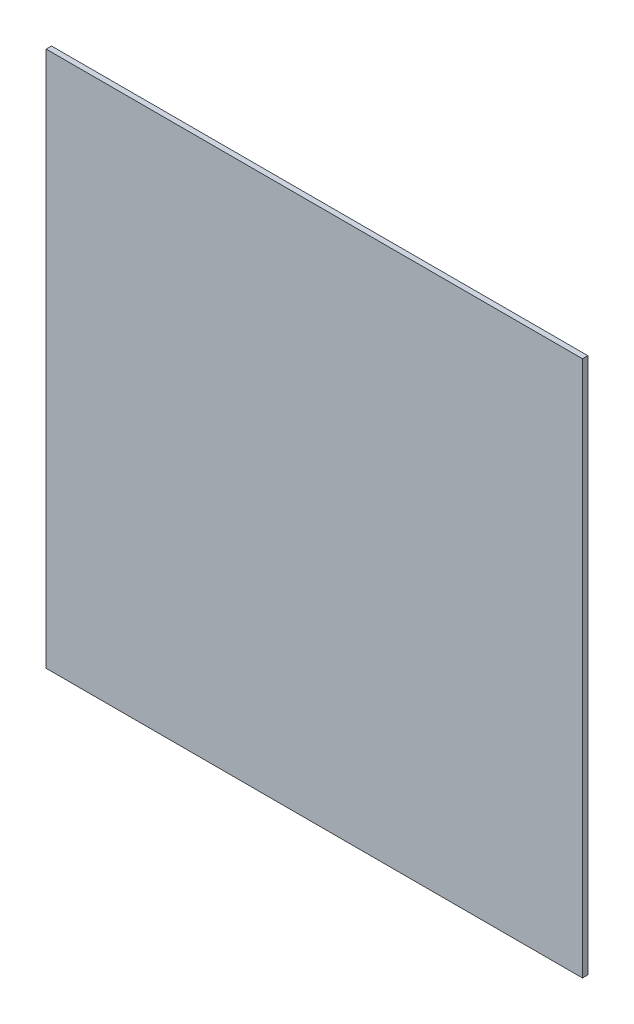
ISO-10303-21;
HEADER;
FILE_DESCRIPTION(('STEP AP214'),'2;1');
FILE_NAME('part.step','',(''),(''),'','','');
FILE_SCHEMA(('AUTOMOTIVE_DESIGN { 1 0 10303 214 1 1 1 1 }'));
ENDSEC;
DATA;
#1=APPLICATION_CONTEXT('core data for automotive mechanical design processes');
#2=APPLICATION_PROTOCOL_DEFINITION('international standard','automotive_design',2000,#1);
#3=PRODUCT_CONTEXT('',#1,'mechanical');
#4=PRODUCT('Part','Part','',(#3));
#5=PRODUCT_RELATED_PRODUCT_CATEGORY('part','',(#4));
#6=PRODUCT_DEFINITION_FORMATION('','',#4);
#7=PRODUCT_DEFINITION_CONTEXT('part definition',#1,'design');
#8=PRODUCT_DEFINITION('design','',#6,#7);
#9=PRODUCT_DEFINITION_SHAPE('','',#8);
#10=(LENGTH_UNIT() NAMED_UNIT(*) SI_UNIT(.MILLI.,.METRE.));
#11=(NAMED_UNIT(*) PLANE_ANGLE_UNIT() SI_UNIT($,.RADIAN.));
#12=(NAMED_UNIT(*) SI_UNIT($,.STERADIAN.) SOLID_ANGLE_UNIT());
#13=UNCERTAINTY_MEASURE_WITH_UNIT(LENGTH_MEASURE(1.E-05),#10,'distance_accuracy_value','');
#14=(GEOMETRIC_REPRESENTATION_CONTEXT(3) GLOBAL_UNCERTAINTY_ASSIGNED_CONTEXT((#13)) GLOBAL_UNIT_ASSIGNED_CONTEXT((#10,
#11,#12)) REPRESENTATION_CONTEXT('',''));
#15=CARTESIAN_POINT('',(0.,0.,0.));
#16=DIRECTION('',(0.,0.,1.));
#17=DIRECTION('',(1.,0.,0.));
#18=AXIS2_PLACEMENT_3D('',#15,#16,#17);
#19=CARTESIAN_POINT('',(0.,0.,2.54));
#20=DIRECTION('',(1.,0.,0.));
#21=DIRECTION('',(0.,0.,-1.));
#22=AXIS2_PLACEMENT_3D('',#19,#20,#21);
#23=PLANE('',#22);
#24=DIRECTION('',(0.,-1.,0.));
#25=VECTOR('',#24,1.);
#26=CARTESIAN_POINT('',(0.,0.,0.));
#27=LINE('',#26,#25);
#28=CARTESIAN_POINT('',(0.,254.,0.));
#29=VERTEX_POINT('',#28);
#30=CARTESIAN_POINT('',(0.,0.,0.));
#31=VERTEX_POINT('',#30);
#32=EDGE_CURVE('E96',#29,#31,#27,.T.);
#33=ORIENTED_EDGE('',*,*,#32,.T.);
#34=DIRECTION('',(0.,0.,-1.));
#35=VECTOR('',#34,1.);
#36=CARTESIAN_POINT('',(0.,0.,2.54));
#37=LINE('',#36,#35);
#38=CARTESIAN_POINT('',(0.,0.,2.54));
#39=VERTEX_POINT('',#38);
#40=EDGE_CURVE('E11',#39,#31,#37,.T.);
#41=ORIENTED_EDGE('',*,*,#40,.F.);
#42=DIRECTION('',(0.,-1.,0.));
#43=VECTOR('',#42,1.);
#44=CARTESIAN_POINT('',(0.,0.,2.54));
#45=LINE('',#44,#43);
#46=CARTESIAN_POINT('',(0.,254.,2.54));
#47=VERTEX_POINT('',#46);
#48=EDGE_CURVE('E84',#47,#39,#45,.T.);
#49=ORIENTED_EDGE('',*,*,#48,.F.);
#50=DIRECTION('',(0.,0.,-1.));
#51=VECTOR('',#50,1.);
#52=CARTESIAN_POINT('',(0.,254.,2.54));
#53=LINE('',#52,#51);
#54=EDGE_CURVE('E92',#47,#29,#53,.T.);
#55=ORIENTED_EDGE('',*,*,#54,.T.);
#56=EDGE_LOOP('',(#33,#41,#49,#55));
#57=FACE_BOUND('',#56,.T.);
#58=ADVANCED_FACE('F33',(#57),#23,.F.);
#59=CARTESIAN_POINT('',(0.,0.,2.54));
#60=DIRECTION('',(0.,1.,0.));
#61=DIRECTION('',(0.,0.,1.));
#62=AXIS2_PLACEMENT_3D('',#59,#60,#61);
#63=PLANE('',#62);
#64=DIRECTION('',(1.,0.,0.));
#65=VECTOR('',#64,1.);
#66=CARTESIAN_POINT('',(0.,0.,0.));
#67=LINE('',#66,#65);
#68=CARTESIAN_POINT('',(254.,0.,0.));
#69=VERTEX_POINT('',#68);
#70=EDGE_CURVE('E88',#31,#69,#67,.T.);
#71=ORIENTED_EDGE('',*,*,#70,.T.);
#72=DIRECTION('',(0.,0.,-1.));
#73=VECTOR('',#72,1.);
#74=CARTESIAN_POINT('',(254.,0.,2.54));
#75=LINE('',#74,#73);
#76=CARTESIAN_POINT('',(254.,0.,2.54));
#77=VERTEX_POINT('',#76);
#78=EDGE_CURVE('E41',#77,#69,#75,.T.);
#79=ORIENTED_EDGE('',*,*,#78,.F.);
#80=DIRECTION('',(1.,0.,0.));
#81=VECTOR('',#80,1.);
#82=CARTESIAN_POINT('',(0.,0.,2.54));
#83=LINE('',#82,#81);
#84=EDGE_CURVE('E79',#39,#77,#83,.T.);
#85=ORIENTED_EDGE('',*,*,#84,.F.);
#86=ORIENTED_EDGE('',*,*,#40,.T.);
#87=EDGE_LOOP('',(#71,#79,#85,#86));
#88=FACE_BOUND('',#87,.T.);
#89=ADVANCED_FACE('F87',(#88),#63,.F.);
#90=CARTESIAN_POINT('',(254.,0.,2.54));
#91=DIRECTION('',(-1.,0.,0.));
#92=DIRECTION('',(0.,0.,1.));
#93=AXIS2_PLACEMENT_3D('',#90,#91,#92);
#94=PLANE('',#93);
#95=DIRECTION('',(0.,1.,0.));
#96=VECTOR('',#95,1.);
#97=CARTESIAN_POINT('',(254.,0.,0.));
#98=LINE('',#97,#96);
#99=CARTESIAN_POINT('',(254.,254.,0.));
#100=VERTEX_POINT('',#99);
#101=EDGE_CURVE('E66',#69,#100,#98,.T.);
#102=ORIENTED_EDGE('',*,*,#101,.T.);
#103=DIRECTION('',(0.,0.,-1.));
#104=VECTOR('',#103,1.);
#105=CARTESIAN_POINT('',(254.,254.,2.54));
#106=LINE('',#105,#104);
#107=CARTESIAN_POINT('',(254.,254.,2.54));
#108=VERTEX_POINT('',#107);
#109=EDGE_CURVE('E89',#108,#100,#106,.T.);
#110=ORIENTED_EDGE('',*,*,#109,.F.);
#111=DIRECTION('',(0.,1.,0.));
#112=VECTOR('',#111,1.);
#113=CARTESIAN_POINT('',(254.,0.,2.54));
#114=LINE('',#113,#112);
#115=EDGE_CURVE('E82',#77,#108,#114,.T.);
#116=ORIENTED_EDGE('',*,*,#115,.F.);
#117=ORIENTED_EDGE('',*,*,#78,.T.);
#118=EDGE_LOOP('',(#102,#110,#116,#117));
#119=FACE_BOUND('',#118,.T.);
#120=ADVANCED_FACE('F90',(#119),#94,.F.);
#121=CARTESIAN_POINT('',(0.,254.,2.54));
#122=DIRECTION('',(0.,-1.,0.));
#123=DIRECTION('',(0.,0.,-1.));
#124=AXIS2_PLACEMENT_3D('',#121,#122,#123);
#125=PLANE('',#124);
#126=DIRECTION('',(-1.,0.,0.));
#127=VECTOR('',#126,1.);
#128=CARTESIAN_POINT('',(0.,254.,0.));
#129=LINE('',#128,#127);
#130=EDGE_CURVE('E72',#100,#29,#129,.T.);
#131=ORIENTED_EDGE('',*,*,#130,.T.);
#132=ORIENTED_EDGE('',*,*,#54,.F.);
#133=DIRECTION('',(-1.,0.,0.));
#134=VECTOR('',#133,1.);
#135=CARTESIAN_POINT('',(0.,254.,2.54));
#136=LINE('',#135,#134);
#137=EDGE_CURVE('E49',#108,#47,#136,.T.);
#138=ORIENTED_EDGE('',*,*,#137,.F.);
#139=ORIENTED_EDGE('',*,*,#109,.T.);
#140=EDGE_LOOP('',(#131,#132,#138,#139));
#141=FACE_BOUND('',#140,.T.);
#142=ADVANCED_FACE('F103',(#141),#125,.F.);
#143=CARTESIAN_POINT('',(0.,0.,2.54));
#144=DIRECTION('',(0.,0.,-1.));
#145=DIRECTION('',(-1.,0.,0.));
#146=AXIS2_PLACEMENT_3D('',#143,#144,#145);
#147=PLANE('',#146);
#148=ORIENTED_EDGE('',*,*,#48,.T.);
#149=ORIENTED_EDGE('',*,*,#84,.T.);
#150=ORIENTED_EDGE('',*,*,#115,.T.);
#151=ORIENTED_EDGE('',*,*,#137,.T.);
#152=EDGE_LOOP('',(#148,#149,#150,#151));
#153=FACE_BOUND('',#152,.T.);
#154=ADVANCED_FACE('F80',(#153),#147,.F.);
#155=CARTESIAN_POINT('',(0.,0.,0.));
#156=DIRECTION('',(0.,0.,-1.));
#157=DIRECTION('',(-1.,0.,0.));
#158=AXIS2_PLACEMENT_3D('',#155,#156,#157);
#159=PLANE('',#158);
#160=ORIENTED_EDGE('',*,*,#32,.F.);
#161=ORIENTED_EDGE('',*,*,#130,.F.);
#162=ORIENTED_EDGE('',*,*,#101,.F.);
#163=ORIENTED_EDGE('',*,*,#70,.F.);
#164=EDGE_LOOP('',(#160,#161,#162,#163));
#165=FACE_BOUND('',#164,.T.);
#166=ADVANCED_FACE('F106',(#165),#159,.T.);
#167=CLOSED_SHELL('',(#58,#89,#120,#142,#154,#166));
#168=MANIFOLD_SOLID_BREP('B2',#167);
#169=ADVANCED_BREP_SHAPE_REPRESENTATION('',(#18,#168),#14);
#170=SHAPE_DEFINITION_REPRESENTATION(#9,#169);
ENDSEC;
END-ISO-10303-21;
